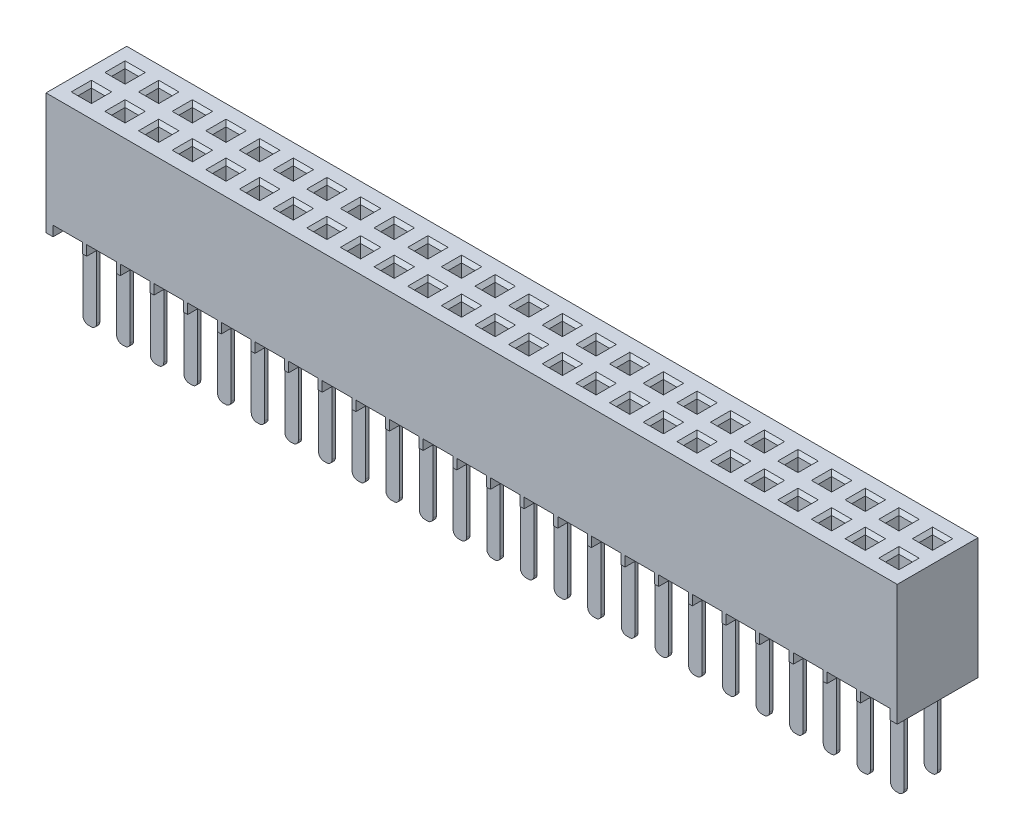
from build123d import *

# Parameters (mm, degrees)
SKETCH1_W                     = 3.048
SKETCH1_H                     = 4.572
MAIN_BODY_DEPTH               = 0.635
SKETCH2_W                     = 0.508
SKETCH2_H                     = 0.508
SQUARE_SLOT_DEPTH             = 0.762
CHAMFER1_SIZE                 = 0.127
SKETCH20_W                    = 1.1176
SKETCH20_H                    = 0.381
CUT_EXTRUDE1_DEPTH            = 6.035754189
SLOT_PATTERN_COUNT            = 25
SLOT_PATTERN_PITCH            = 1.27
CHAMFER1_OF_SLOT_PATTERN_SIZE = 0.127
END_WALL_1_REACH              = 34.302
SKETCH17_W                    = 3.048
SKETCH17_H                    = 4.572
END_WALL_2_REACH              = 34.49
SKETCH16_W                    = 3.048
SKETCH16_H                    = 4.572
SKETCH21_W                    = 0.127
SKETCH21_H                    = 3.429
PINSTRAIGHT_DEPTH             = 0.254
FILLET1_R                     = 0.2032
LPATTERN1_COUNT               = 25
LPATTERN1_PITCH               = 1.27
FILLET1_OF_LPATTERN1_R        = 0.2032


with BuildPart() as part:
    # Sketch1 → Main_Body (new, symmetric)
    with BuildSketch(Plane(origin=(0.8255, 0, 0), x_dir=(0, 0, -1), z_dir=(1, 0, 0))):
        with Locations((0, 2.286)):
            Rectangle(SKETCH1_W, SKETCH1_H)
    main_body = extrude(amount=MAIN_BODY_DEPTH, both=True)

    # Sketch2 → Square_Slot (cut)
    with BuildSketch(Plane(origin=(0, 4.572, 0), x_dir=(1, 0, 0), z_dir=(0, 1, 0))):
        with Locations((0.8255, -0.635)):
            Rectangle(SKETCH2_W, SKETCH2_H)
        with Locations((0.8255, 0.635)):
            Rectangle(SKETCH2_W, SKETCH2_H)
    square_slot = extrude(amount=-SQUARE_SLOT_DEPTH, mode=Mode.SUBTRACT)

    # Chamfer1
    chamfer1_edges = [part.edges().sort_by_distance(p)[0] for p in [
        (0.5715, 4.572, -0.635),
        (0.8255, 4.572, -0.381),
        (1.0795, 4.572, -0.635),
        (0.8255, 4.572, -0.889),
        (0.8255, 4.572, 0.381),
        (0.5715, 4.572, 0.635),
        (0.8255, 4.572, 0.889),
        (1.0795, 4.572, 0.635),
    ]]
    chamfer(chamfer1_edges, length=CHAMFER1_SIZE)

    # Sketch20 → Cut-Extrude1 (cut, symmetric)
    with BuildSketch(Plane.XY):
        with Locations((0.8255, 0.1905)):
            Rectangle(SKETCH20_W, SKETCH20_H)
    cut_extrude1 = extrude(amount=CUT_EXTRUDE1_DEPTH, both=True, mode=Mode.SUBTRACT)

    # Slot_Pattern: Main_Body, Square_Slot, Cut-Extrude1 ×25
    with Locations(*[(i * SLOT_PATTERN_PITCH, 0, 0) for i in range(1, SLOT_PATTERN_COUNT)]):
        add(main_body)
        add(square_slot, mode=Mode.SUBTRACT)
        add(cut_extrude1, mode=Mode.SUBTRACT)

    # Chamfer1 of Slot_Pattern
    chamfer1_of_slot_pattern_edges = [part.edges().sort_by_distance(p)[0] for p in [
        (1.8415, 4.572, -0.635),
        (2.0955, 4.572, -0.381),
        (2.3495, 4.572, -0.635),
        (2.0955, 4.572, -0.889),
        (2.0955, 4.572, 0.381),
        (1.8415, 4.572, 0.635),
        (2.0955, 4.572, 0.889),
        (2.3495, 4.572, 0.635),
        (3.1115, 4.572, -0.635),
        (3.3655, 4.572, -0.381),
        (3.6195, 4.572, -0.635),
        (3.3655, 4.572, -0.889),
        (3.3655, 4.572, 0.381),
        (3.1115, 4.572, 0.635),
        (3.3655, 4.572, 0.889),
        (3.6195, 4.572, 0.635),
        (4.3815, 4.572, -0.635),
        (4.6355, 4.572, -0.381),
        (4.8895, 4.572, -0.635),
        (4.6355, 4.572, -0.889),
        (4.6355, 4.572, 0.381),
        (4.3815, 4.572, 0.635),
        (4.6355, 4.572, 0.889),
        (4.8895, 4.572, 0.635),
        (5.6515, 4.572, -0.635),
        (5.9055, 4.572, -0.381),
        (6.1595, 4.572, -0.635),
        (5.9055, 4.572, -0.889),
        (5.9055, 4.572, 0.381),
        (5.6515, 4.572, 0.635),
        (5.9055, 4.572, 0.889),
        (6.1595, 4.572, 0.635),
        (6.9215, 4.572, -0.635),
        (7.1755, 4.572, -0.381),
        (7.4295, 4.572, -0.635),
        (7.1755, 4.572, -0.889),
        (7.1755, 4.572, 0.381),
        (6.9215, 4.572, 0.635),
        (7.1755, 4.572, 0.889),
        (7.4295, 4.572, 0.635),
        (8.1915, 4.572, -0.635),
        (8.4455, 4.572, -0.381),
        (8.6995, 4.572, -0.635),
        (8.4455, 4.572, -0.889),
        (8.4455, 4.572, 0.381),
        (8.1915, 4.572, 0.635),
        (8.4455, 4.572, 0.889),
        (8.6995, 4.572, 0.635),
        (9.4615, 4.572, -0.635),
        (9.7155, 4.572, -0.381),
        (9.9695, 4.572, -0.635),
        (9.7155, 4.572, -0.889),
        (9.7155, 4.572, 0.381),
        (9.4615, 4.572, 0.635),
        (9.7155, 4.572, 0.889),
        (9.9695, 4.572, 0.635),
        (10.7315, 4.572, -0.635),
        (10.9855, 4.572, -0.381),
        (11.2395, 4.572, -0.635),
        (10.9855, 4.572, -0.889),
        (10.9855, 4.572, 0.381),
        (10.7315, 4.572, 0.635),
        (10.9855, 4.572, 0.889),
        (11.2395, 4.572, 0.635),
        (12.0015, 4.572, -0.635),
        (12.2555, 4.572, -0.381),
        (12.5095, 4.572, -0.635),
        (12.2555, 4.572, -0.889),
        (12.2555, 4.572, 0.381),
        (12.0015, 4.572, 0.635),
        (12.2555, 4.572, 0.889),
        (12.5095, 4.572, 0.635),
        (13.2715, 4.572, -0.635),
        (13.5255, 4.572, -0.381),
        (13.7795, 4.572, -0.635),
        (13.5255, 4.572, -0.889),
        (13.5255, 4.572, 0.381),
        (13.2715, 4.572, 0.635),
        (13.5255, 4.572, 0.889),
        (13.7795, 4.572, 0.635),
        (14.5415, 4.572, -0.635),
        (14.7955, 4.572, -0.381),
        (15.0495, 4.572, -0.635),
        (14.7955, 4.572, -0.889),
        (14.7955, 4.572, 0.381),
        (14.5415, 4.572, 0.635),
        (14.7955, 4.572, 0.889),
        (15.0495, 4.572, 0.635),
        (15.8115, 4.572, -0.635),
        (16.0655, 4.572, -0.381),
        (16.3195, 4.572, -0.635),
        (16.0655, 4.572, -0.889),
        (16.0655, 4.572, 0.381),
        (15.8115, 4.572, 0.635),
        (16.0655, 4.572, 0.889),
        (16.3195, 4.572, 0.635),
        (17.0815, 4.572, -0.635),
        (17.3355, 4.572, -0.381),
        (17.5895, 4.572, -0.635),
        (17.3355, 4.572, -0.889),
        (17.3355, 4.572, 0.381),
        (17.0815, 4.572, 0.635),
        (17.3355, 4.572, 0.889),
        (17.5895, 4.572, 0.635),
        (18.3515, 4.572, -0.635),
        (18.6055, 4.572, -0.381),
        (18.8595, 4.572, -0.635),
        (18.6055, 4.572, -0.889),
        (18.6055, 4.572, 0.381),
        (18.3515, 4.572, 0.635),
        (18.6055, 4.572, 0.889),
        (18.8595, 4.572, 0.635),
        (19.6215, 4.572, -0.635),
        (19.8755, 4.572, -0.381),
        (20.1295, 4.572, -0.635),
        (19.8755, 4.572, -0.889),
        (19.8755, 4.572, 0.381),
        (19.6215, 4.572, 0.635),
        (19.8755, 4.572, 0.889),
        (20.1295, 4.572, 0.635),
        (20.8915, 4.572, -0.635),
        (21.1455, 4.572, -0.381),
        (21.3995, 4.572, -0.635),
        (21.1455, 4.572, -0.889),
        (21.1455, 4.572, 0.381),
        (20.8915, 4.572, 0.635),
        (21.1455, 4.572, 0.889),
        (21.3995, 4.572, 0.635),
        (22.1615, 4.572, -0.635),
        (22.4155, 4.572, -0.381),
        (22.6695, 4.572, -0.635),
        (22.4155, 4.572, -0.889),
        (22.4155, 4.572, 0.381),
        (22.1615, 4.572, 0.635),
        (22.4155, 4.572, 0.889),
        (22.6695, 4.572, 0.635),
        (23.4315, 4.572, -0.635),
        (23.6855, 4.572, -0.381),
        (23.9395, 4.572, -0.635),
        (23.6855, 4.572, -0.889),
        (23.6855, 4.572, 0.381),
        (23.4315, 4.572, 0.635),
        (23.6855, 4.572, 0.889),
        (23.9395, 4.572, 0.635),
        (24.7015, 4.572, -0.635),
        (24.9555, 4.572, -0.381),
        (25.2095, 4.572, -0.635),
        (24.9555, 4.572, -0.889),
        (24.9555, 4.572, 0.381),
        (24.7015, 4.572, 0.635),
        (24.9555, 4.572, 0.889),
        (25.2095, 4.572, 0.635),
        (25.9715, 4.572, -0.635),
        (26.2255, 4.572, -0.381),
        (26.4795, 4.572, -0.635),
        (26.2255, 4.572, -0.889),
        (26.2255, 4.572, 0.381),
        (25.9715, 4.572, 0.635),
        (26.2255, 4.572, 0.889),
        (26.4795, 4.572, 0.635),
        (27.2415, 4.572, -0.635),
        (27.4955, 4.572, -0.381),
        (27.7495, 4.572, -0.635),
        (27.4955, 4.572, -0.889),
        (27.4955, 4.572, 0.381),
        (27.2415, 4.572, 0.635),
        (27.4955, 4.572, 0.889),
        (27.7495, 4.572, 0.635),
        (28.5115, 4.572, -0.635),
        (28.7655, 4.572, -0.381),
        (29.0195, 4.572, -0.635),
        (28.7655, 4.572, -0.889),
        (28.7655, 4.572, 0.381),
        (28.5115, 4.572, 0.635),
        (28.7655, 4.572, 0.889),
        (29.0195, 4.572, 0.635),
        (29.7815, 4.572, -0.635),
        (30.0355, 4.572, -0.381),
        (30.2895, 4.572, -0.635),
        (30.0355, 4.572, -0.889),
        (30.0355, 4.572, 0.381),
        (29.7815, 4.572, 0.635),
        (30.0355, 4.572, 0.889),
        (30.2895, 4.572, 0.635),
        (31.0515, 4.572, -0.635),
        (31.3055, 4.572, -0.381),
        (31.5595, 4.572, -0.635),
        (31.3055, 4.572, -0.889),
        (31.3055, 4.572, 0.381),
        (31.0515, 4.572, 0.635),
        (31.3055, 4.572, 0.889),
        (31.5595, 4.572, 0.635),
    ]]
    chamfer(chamfer1_of_slot_pattern_edges, length=CHAMFER1_OF_SLOT_PATTERN_SIZE)

    # Sketch17 → End_Wall_1 (add, up to next)
    with BuildSketch(Plane(origin=(0, 0, 0), x_dir=(0, 0, -1), z_dir=(1, 0, 0)), mode=Mode.PRIVATE) as end_wall_1_sk1:
        with Locations((0, 2.286)):
            Rectangle(SKETCH17_W, SKETCH17_H)
    end_wall_1_tool1 = extrude(end_wall_1_sk1.sketch, amount=END_WALL_1_REACH, mode=Mode.PRIVATE) - part.part
    add(end_wall_1_tool1.solids().sort_by_distance((0, 2.286, 0))[0])

    # Sketch16 → End_Wall_2 (add, up to next)
    with BuildSketch(Plane(origin=(32.131, 0, 0), x_dir=(0, 0, -1), z_dir=(1, 0, 0)), mode=Mode.PRIVATE) as end_wall_2_sk1:
        with Locations((0, 2.286)):
            Rectangle(SKETCH16_W, SKETCH16_H)
    end_wall_2_tool1 = extrude(end_wall_2_sk1.sketch, amount=-END_WALL_2_REACH, mode=Mode.PRIVATE) - part.part
    add(end_wall_2_tool1.solids().sort_by_distance((32.131, 2.286, 0))[0])

    # Sketch21 → PinStraight (add, symmetric)
    with BuildSketch(Plane(origin=(0.8255, 0, 0), x_dir=(0, 0, -1), z_dir=(1, 0, 0))):
        with Locations((0.635, -1.3335)):
            Rectangle(SKETCH21_W, SKETCH21_H)
        with Locations((-0.635, -1.3335)):
            Rectangle(SKETCH21_W, SKETCH21_H)
    pinstraight = extrude(amount=PINSTRAIGHT_DEPTH, both=True)

    # Fillet1
    fillet1_edges = [part.edges().sort_by_distance(p)[0] for p in [
        (0.5715, -3.048, -0.635),
        (1.0795, -3.048, -0.635),
        (0.5715, -3.048, 0.635),
        (1.0795, -3.048, 0.635),
    ]]
    fillet(fillet1_edges, radius=FILLET1_R)

    # LPattern1: PinStraight ×25
    with Locations(*[(i * LPATTERN1_PITCH, 0, 0) for i in range(1, LPATTERN1_COUNT)]):
        add(pinstraight)

    # Fillet1 of LPattern1
    fillet1_of_lpattern1_edges = [part.edges().sort_by_distance(p)[0] for p in [
        (1.8415, -3.048, -0.635),
        (2.3495, -3.048, -0.635),
        (1.8415, -3.048, 0.635),
        (2.3495, -3.048, 0.635),
        (3.1115, -3.048, -0.635),
        (3.6195, -3.048, -0.635),
        (3.1115, -3.048, 0.635),
        (3.6195, -3.048, 0.635),
        (4.3815, -3.048, -0.635),
        (4.8895, -3.048, -0.635),
        (4.3815, -3.048, 0.635),
        (4.8895, -3.048, 0.635),
        (5.6515, -3.048, -0.635),
        (6.1595, -3.048, -0.635),
        (5.6515, -3.048, 0.635),
        (6.1595, -3.048, 0.635),
        (6.9215, -3.048, -0.635),
        (7.4295, -3.048, -0.635),
        (6.9215, -3.048, 0.635),
        (7.4295, -3.048, 0.635),
        (8.1915, -3.048, -0.635),
        (8.6995, -3.048, -0.635),
        (8.1915, -3.048, 0.635),
        (8.6995, -3.048, 0.635),
        (9.4615, -3.048, -0.635),
        (9.9695, -3.048, -0.635),
        (9.4615, -3.048, 0.635),
        (9.9695, -3.048, 0.635),
        (10.7315, -3.048, -0.635),
        (11.2395, -3.048, -0.635),
        (10.7315, -3.048, 0.635),
        (11.2395, -3.048, 0.635),
        (12.0015, -3.048, -0.635),
        (12.5095, -3.048, -0.635),
        (12.0015, -3.048, 0.635),
        (12.5095, -3.048, 0.635),
        (13.2715, -3.048, -0.635),
        (13.7795, -3.048, -0.635),
        (13.2715, -3.048, 0.635),
        (13.7795, -3.048, 0.635),
        (14.5415, -3.048, -0.635),
        (15.0495, -3.048, -0.635),
        (14.5415, -3.048, 0.635),
        (15.0495, -3.048, 0.635),
        (15.8115, -3.048, -0.635),
        (16.3195, -3.048, -0.635),
        (15.8115, -3.048, 0.635),
        (16.3195, -3.048, 0.635),
        (17.0815, -3.048, -0.635),
        (17.5895, -3.048, -0.635),
        (17.0815, -3.048, 0.635),
        (17.5895, -3.048, 0.635),
        (18.3515, -3.048, -0.635),
        (18.8595, -3.048, -0.635),
        (18.3515, -3.048, 0.635),
        (18.8595, -3.048, 0.635),
        (19.6215, -3.048, -0.635),
        (20.1295, -3.048, -0.635),
        (19.6215, -3.048, 0.635),
        (20.1295, -3.048, 0.635),
        (20.8915, -3.048, -0.635),
        (21.3995, -3.048, -0.635),
        (20.8915, -3.048, 0.635),
        (21.3995, -3.048, 0.635),
        (22.1615, -3.048, -0.635),
        (22.6695, -3.048, -0.635),
        (22.1615, -3.048, 0.635),
        (22.6695, -3.048, 0.635),
        (23.4315, -3.048, -0.635),
        (23.9395, -3.048, -0.635),
        (23.4315, -3.048, 0.635),
        (23.9395, -3.048, 0.635),
        (24.7015, -3.048, -0.635),
        (25.2095, -3.048, -0.635),
        (24.7015, -3.048, 0.635),
        (25.2095, -3.048, 0.635),
        (25.9715, -3.048, -0.635),
        (26.4795, -3.048, -0.635),
        (25.9715, -3.048, 0.635),
        (26.4795, -3.048, 0.635),
        (27.2415, -3.048, -0.635),
        (27.7495, -3.048, -0.635),
        (27.2415, -3.048, 0.635),
        (27.7495, -3.048, 0.635),
        (28.5115, -3.048, -0.635),
        (29.0195, -3.048, -0.635),
        (28.5115, -3.048, 0.635),
        (29.0195, -3.048, 0.635),
        (29.7815, -3.048, -0.635),
        (30.2895, -3.048, -0.635),
        (29.7815, -3.048, 0.635),
        (30.2895, -3.048, 0.635),
        (31.0515, -3.048, -0.635),
        (31.5595, -3.048, -0.635),
        (31.0515, -3.048, 0.635),
        (31.5595, -3.048, 0.635),
    ]]
    fillet(fillet1_of_lpattern1_edges, radius=FILLET1_OF_LPATTERN1_R)


solid = part.part
